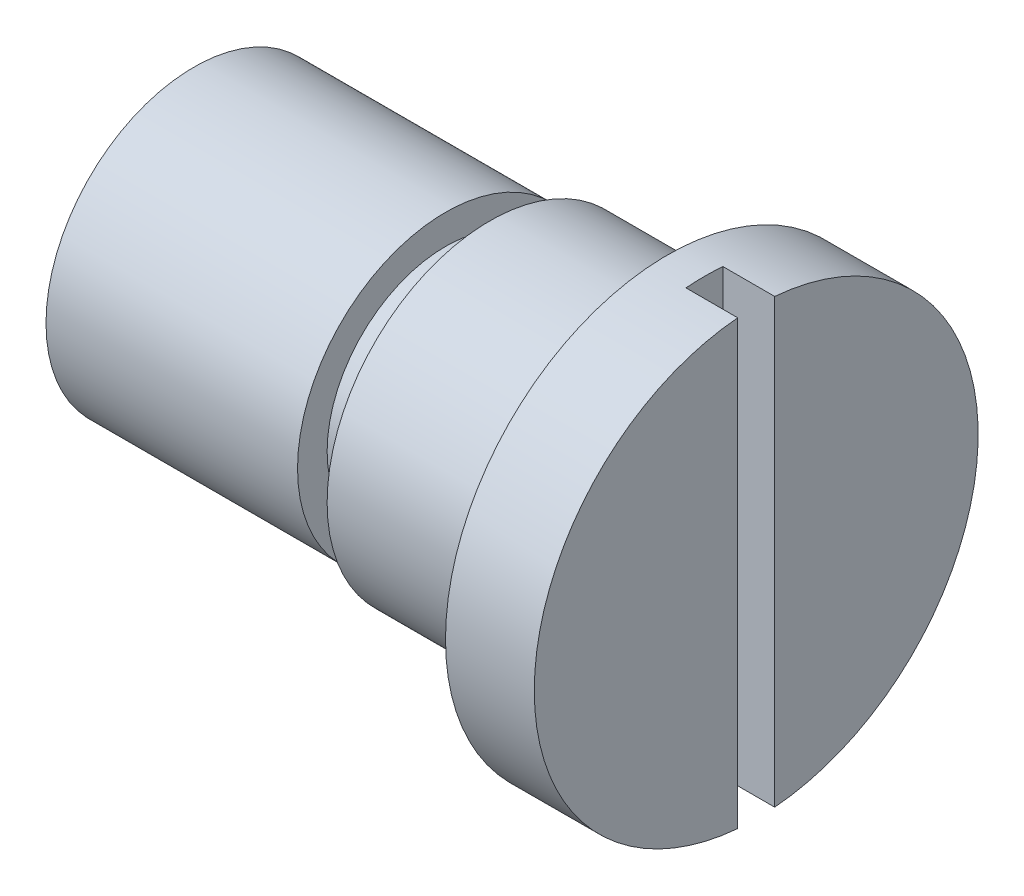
ISO-10303-21;
HEADER;
FILE_DESCRIPTION(('STEP AP214'),'2;1');
FILE_NAME('part.step','',(''),(''),'','','');
FILE_SCHEMA(('AUTOMOTIVE_DESIGN { 1 0 10303 214 1 1 1 1 }'));
ENDSEC;
DATA;
#1=APPLICATION_CONTEXT('core data for automotive mechanical design processes');
#2=APPLICATION_PROTOCOL_DEFINITION('international standard','automotive_design',2000,#1);
#3=PRODUCT_CONTEXT('',#1,'mechanical');
#4=PRODUCT('Part','Part','',(#3));
#5=PRODUCT_RELATED_PRODUCT_CATEGORY('part','',(#4));
#6=PRODUCT_DEFINITION_FORMATION('','',#4);
#7=PRODUCT_DEFINITION_CONTEXT('part definition',#1,'design');
#8=PRODUCT_DEFINITION('design','',#6,#7);
#9=PRODUCT_DEFINITION_SHAPE('','',#8);
#10=(LENGTH_UNIT() NAMED_UNIT(*) SI_UNIT(.MILLI.,.METRE.));
#11=(NAMED_UNIT(*) PLANE_ANGLE_UNIT() SI_UNIT($,.RADIAN.));
#12=(NAMED_UNIT(*) SI_UNIT($,.STERADIAN.) SOLID_ANGLE_UNIT());
#13=UNCERTAINTY_MEASURE_WITH_UNIT(LENGTH_MEASURE(1.E-05),#10,'distance_accuracy_value','');
#14=(GEOMETRIC_REPRESENTATION_CONTEXT(3) GLOBAL_UNCERTAINTY_ASSIGNED_CONTEXT((#13)) GLOBAL_UNIT_ASSIGNED_CONTEXT((#10,
#11,#12)) REPRESENTATION_CONTEXT('',''));
#15=CARTESIAN_POINT('',(0.,0.,0.));
#16=DIRECTION('',(0.,0.,1.));
#17=DIRECTION('',(1.,0.,0.));
#18=AXIS2_PLACEMENT_3D('',#15,#16,#17);
#19=CARTESIAN_POINT('',(38.,15.,0.));
#20=DIRECTION('',(-1.,0.,0.));
#21=DIRECTION('',(0.,0.,1.));
#22=AXIS2_PLACEMENT_3D('',#19,#20,#21);
#23=PLANE('',#22);
#24=CARTESIAN_POINT('',(38.,1.35308431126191E-13,0.));
#25=DIRECTION('',(-1.,0.,0.));
#26=DIRECTION('',(0.,0.,1.));
#27=AXIS2_PLACEMENT_3D('',#24,#25,#26);
#28=CIRCLE('',#27,15.);
#29=CARTESIAN_POINT('',(38.,-14.9478259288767,1.25000000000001));
#30=VERTEX_POINT('',#29);
#31=CARTESIAN_POINT('',(38.,14.9478259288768,1.25));
#32=VERTEX_POINT('',#31);
#33=EDGE_CURVE('E86',#30,#32,#28,.T.);
#34=ORIENTED_EDGE('',*,*,#33,.F.);
#35=DIRECTION('',(0.,1.,0.));
#36=VECTOR('',#35,1.);
#37=CARTESIAN_POINT('',(38.,15.0000000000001,1.25000000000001));
#38=LINE('',#37,#36);
#39=EDGE_CURVE('E110',#30,#32,#38,.T.);
#40=ORIENTED_EDGE('',*,*,#39,.T.);
#41=EDGE_LOOP('',(#34,#40));
#42=FACE_BOUND('',#41,.T.);
#43=ADVANCED_FACE('F24',(#42),#23,.F.);
#44=CARTESIAN_POINT('',(0.,0.,0.));
#45=DIRECTION('',(1.,0.,0.));
#46=DIRECTION('',(0.,0.,-1.));
#47=AXIS2_PLACEMENT_3D('',#44,#45,#46);
#48=PLANE('',#47);
#49=CARTESIAN_POINT('',(0.,0.,0.));
#50=DIRECTION('',(-1.,0.,0.));
#51=DIRECTION('',(0.,0.,1.));
#52=AXIS2_PLACEMENT_3D('',#49,#50,#51);
#53=CIRCLE('',#52,10.);
#54=CARTESIAN_POINT('',(0.,0.,10.));
#55=VERTEX_POINT('',#54);
#56=EDGE_CURVE('E106',#55,#55,#53,.T.);
#57=ORIENTED_EDGE('',*,*,#56,.T.);
#58=EDGE_LOOP('',(#57));
#59=FACE_BOUND('',#58,.T.);
#60=ADVANCED_FACE('F26',(#59),#48,.F.);
#61=CARTESIAN_POINT('',(-36.4678714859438,0.,0.));
#62=DIRECTION('',(-1.,0.,0.));
#63=DIRECTION('',(0.,0.,1.));
#64=AXIS2_PLACEMENT_3D('',#61,#62,#63);
#65=CYLINDRICAL_SURFACE('',#64,10.);
#66=ORIENTED_EDGE('',*,*,#56,.F.);
#67=EDGE_LOOP('',(#66));
#68=FACE_BOUND('',#67,.T.);
#69=CARTESIAN_POINT('',(17.,0.,0.));
#70=DIRECTION('',(-1.,0.,0.));
#71=DIRECTION('',(0.,0.,1.));
#72=AXIS2_PLACEMENT_3D('',#69,#70,#71);
#73=CIRCLE('',#72,10.);
#74=CARTESIAN_POINT('',(17.,0.,10.));
#75=VERTEX_POINT('',#74);
#76=EDGE_CURVE('E103',#75,#75,#73,.T.);
#77=ORIENTED_EDGE('',*,*,#76,.T.);
#78=EDGE_LOOP('',(#77));
#79=FACE_BOUND('',#78,.T.);
#80=ADVANCED_FACE('F125',(#68,#79),#65,.T.);
#81=CARTESIAN_POINT('',(17.,10.,0.));
#82=DIRECTION('',(-1.,0.,0.));
#83=DIRECTION('',(0.,0.,1.));
#84=AXIS2_PLACEMENT_3D('',#81,#82,#83);
#85=PLANE('',#84);
#86=ORIENTED_EDGE('',*,*,#76,.F.);
#87=EDGE_LOOP('',(#86));
#88=FACE_BOUND('',#87,.T.);
#89=CARTESIAN_POINT('',(17.,0.,0.));
#90=DIRECTION('',(-1.,0.,0.));
#91=DIRECTION('',(0.,0.,1.));
#92=AXIS2_PLACEMENT_3D('',#89,#90,#91);
#93=CIRCLE('',#92,8.);
#94=CARTESIAN_POINT('',(17.,0.,8.00000000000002));
#95=VERTEX_POINT('',#94);
#96=EDGE_CURVE('E100',#95,#95,#93,.T.);
#97=ORIENTED_EDGE('',*,*,#96,.T.);
#98=EDGE_LOOP('',(#97));
#99=FACE_BOUND('',#98,.T.);
#100=ADVANCED_FACE('F154',(#88,#99),#85,.F.);
#101=CARTESIAN_POINT('',(-36.4678714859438,0.,0.));
#102=DIRECTION('',(-1.,0.,0.));
#103=DIRECTION('',(0.,0.,1.));
#104=AXIS2_PLACEMENT_3D('',#101,#102,#103);
#105=CYLINDRICAL_SURFACE('',#104,8.);
#106=ORIENTED_EDGE('',*,*,#96,.F.);
#107=EDGE_LOOP('',(#106));
#108=FACE_BOUND('',#107,.T.);
#109=CARTESIAN_POINT('',(20.,0.,0.));
#110=DIRECTION('',(-1.,0.,0.));
#111=DIRECTION('',(0.,0.,1.));
#112=AXIS2_PLACEMENT_3D('',#109,#110,#111);
#113=CIRCLE('',#112,8.);
#114=CARTESIAN_POINT('',(20.,0.,8.00000000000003));
#115=VERTEX_POINT('',#114);
#116=EDGE_CURVE('E97',#115,#115,#113,.T.);
#117=ORIENTED_EDGE('',*,*,#116,.T.);
#118=EDGE_LOOP('',(#117));
#119=FACE_BOUND('',#118,.T.);
#120=ADVANCED_FACE('F150',(#108,#119),#105,.T.);
#121=CARTESIAN_POINT('',(20.,8.00000000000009,0.));
#122=DIRECTION('',(1.,0.,0.));
#123=DIRECTION('',(0.,0.,-1.));
#124=AXIS2_PLACEMENT_3D('',#121,#122,#123);
#125=PLANE('',#124);
#126=ORIENTED_EDGE('',*,*,#116,.F.);
#127=EDGE_LOOP('',(#126));
#128=FACE_BOUND('',#127,.T.);
#129=CARTESIAN_POINT('',(20.,0.,0.));
#130=DIRECTION('',(-1.,0.,0.));
#131=DIRECTION('',(0.,0.,1.));
#132=AXIS2_PLACEMENT_3D('',#129,#130,#131);
#133=CIRCLE('',#132,11.);
#134=CARTESIAN_POINT('',(20.,0.,11.));
#135=VERTEX_POINT('',#134);
#136=EDGE_CURVE('E94',#135,#135,#133,.T.);
#137=ORIENTED_EDGE('',*,*,#136,.T.);
#138=EDGE_LOOP('',(#137));
#139=FACE_BOUND('',#138,.T.);
#140=ADVANCED_FACE('F146',(#128,#139),#125,.F.);
#141=CARTESIAN_POINT('',(-36.4678714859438,0.,0.));
#142=DIRECTION('',(-1.,0.,0.));
#143=DIRECTION('',(0.,0.,1.));
#144=AXIS2_PLACEMENT_3D('',#141,#142,#143);
#145=CYLINDRICAL_SURFACE('',#144,11.);
#146=ORIENTED_EDGE('',*,*,#136,.F.);
#147=EDGE_LOOP('',(#146));
#148=FACE_BOUND('',#147,.T.);
#149=CARTESIAN_POINT('',(32.,1.52655665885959E-13,0.));
#150=DIRECTION('',(-1.,0.,0.));
#151=DIRECTION('',(0.,0.,1.));
#152=AXIS2_PLACEMENT_3D('',#149,#150,#151);
#153=CIRCLE('',#152,11.);
#154=CARTESIAN_POINT('',(32.,1.52503010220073E-13,11.));
#155=VERTEX_POINT('',#154);
#156=EDGE_CURVE('E91',#155,#155,#153,.T.);
#157=ORIENTED_EDGE('',*,*,#156,.T.);
#158=EDGE_LOOP('',(#157));
#159=FACE_BOUND('',#158,.T.);
#160=ADVANCED_FACE('F139',(#148,#159),#145,.T.);
#161=CARTESIAN_POINT('',(32.,11.0000000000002,0.));
#162=DIRECTION('',(1.,0.,0.));
#163=DIRECTION('',(0.,0.,-1.));
#164=AXIS2_PLACEMENT_3D('',#161,#162,#163);
#165=PLANE('',#164);
#166=ORIENTED_EDGE('',*,*,#156,.F.);
#167=EDGE_LOOP('',(#166));
#168=FACE_BOUND('',#167,.T.);
#169=CARTESIAN_POINT('',(32.,1.52655665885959E-13,0.));
#170=DIRECTION('',(-1.,0.,0.));
#171=DIRECTION('',(0.,0.,1.));
#172=AXIS2_PLACEMENT_3D('',#169,#170,#171);
#173=CIRCLE('',#172,15.);
#174=CARTESIAN_POINT('',(32.,1.52447499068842E-13,15.0000000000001));
#175=VERTEX_POINT('',#174);
#176=EDGE_CURVE('E88',#175,#175,#173,.T.);
#177=ORIENTED_EDGE('',*,*,#176,.T.);
#178=EDGE_LOOP('',(#177));
#179=FACE_BOUND('',#178,.T.);
#180=ADVANCED_FACE('F134',(#168,#179),#165,.F.);
#181=CARTESIAN_POINT('',(-36.4678714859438,0.,0.));
#182=DIRECTION('',(-1.,0.,0.));
#183=DIRECTION('',(0.,0.,1.));
#184=AXIS2_PLACEMENT_3D('',#181,#182,#183);
#185=CYLINDRICAL_SURFACE('',#184,15.);
#186=ORIENTED_EDGE('',*,*,#176,.F.);
#187=EDGE_LOOP('',(#186));
#188=FACE_BOUND('',#187,.T.);
#189=ORIENTED_EDGE('',*,*,#33,.T.);
#190=DIRECTION('',(-1.,0.,0.));
#191=VECTOR('',#190,1.);
#192=CARTESIAN_POINT('',(-36.4678714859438,14.9478259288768,1.25000000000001));
#193=LINE('',#192,#191);
#194=CARTESIAN_POINT('',(34.5,14.9478259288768,1.25));
#195=VERTEX_POINT('',#194);
#196=EDGE_CURVE('E80',#32,#195,#193,.T.);
#197=ORIENTED_EDGE('',*,*,#196,.T.);
#198=CARTESIAN_POINT('',(34.5,1.52655665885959E-13,0.));
#199=DIRECTION('',(-1.,0.,0.));
#200=DIRECTION('',(0.,0.,1.));
#201=AXIS2_PLACEMENT_3D('',#198,#199,#200);
#202=CIRCLE('',#201,15.);
#203=CARTESIAN_POINT('',(34.5,14.9478259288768,-1.25));
#204=VERTEX_POINT('',#203);
#205=EDGE_CURVE('E28',#195,#204,#202,.T.);
#206=ORIENTED_EDGE('',*,*,#205,.T.);
#207=DIRECTION('',(-1.,0.,0.));
#208=VECTOR('',#207,1.);
#209=CARTESIAN_POINT('',(-36.4678714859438,14.9478259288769,-1.25000000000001));
#210=LINE('',#209,#208);
#211=CARTESIAN_POINT('',(38.,14.9478259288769,-1.25));
#212=VERTEX_POINT('',#211);
#213=EDGE_CURVE('E71',#204,#212,#210,.F.);
#214=ORIENTED_EDGE('',*,*,#213,.T.);
#215=CARTESIAN_POINT('',(38.,-14.9478259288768,-1.25000000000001));
#216=VERTEX_POINT('',#215);
#217=EDGE_CURVE('E77',#212,#216,#28,.T.);
#218=ORIENTED_EDGE('',*,*,#217,.T.);
#219=DIRECTION('',(-1.,0.,0.));
#220=VECTOR('',#219,1.);
#221=CARTESIAN_POINT('',(-36.4678714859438,-14.9478259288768,-1.25000000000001));
#222=LINE('',#221,#220);
#223=CARTESIAN_POINT('',(34.5,-14.9478259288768,-1.25000000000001));
#224=VERTEX_POINT('',#223);
#225=EDGE_CURVE('E39',#216,#224,#222,.T.);
#226=ORIENTED_EDGE('',*,*,#225,.T.);
#227=CARTESIAN_POINT('',(34.5,-14.9478259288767,1.25000000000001));
#228=VERTEX_POINT('',#227);
#229=EDGE_CURVE('E11',#224,#228,#202,.T.);
#230=ORIENTED_EDGE('',*,*,#229,.T.);
#231=DIRECTION('',(-1.,0.,0.));
#232=VECTOR('',#231,1.);
#233=CARTESIAN_POINT('',(-36.4678714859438,-14.9478259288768,1.25000000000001));
#234=LINE('',#233,#232);
#235=EDGE_CURVE('E78',#228,#30,#234,.F.);
#236=ORIENTED_EDGE('',*,*,#235,.T.);
#237=EDGE_LOOP('',(#189,#197,#206,#214,#218,#226,#230,#236));
#238=FACE_BOUND('',#237,.T.);
#239=ADVANCED_FACE('F75',(#188,#238),#185,.T.);
#240=ORIENTED_EDGE('',*,*,#217,.F.);
#241=DIRECTION('',(0.,-1.,0.));
#242=VECTOR('',#241,1.);
#243=CARTESIAN_POINT('',(38.,15.0000000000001,-1.25));
#244=LINE('',#243,#242);
#245=EDGE_CURVE('E109',#212,#216,#244,.T.);
#246=ORIENTED_EDGE('',*,*,#245,.T.);
#247=EDGE_LOOP('',(#240,#246));
#248=FACE_BOUND('',#247,.T.);
#249=ADVANCED_FACE('F119',(#248),#23,.F.);
#250=CARTESIAN_POINT('',(34.5,-15.,-1.25000000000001));
#251=DIRECTION('',(-1.,0.,0.));
#252=DIRECTION('',(0.,0.,1.));
#253=AXIS2_PLACEMENT_3D('',#250,#251,#252);
#254=PLANE('',#253);
#255=DIRECTION('',(0.,1.,0.));
#256=VECTOR('',#255,1.);
#257=CARTESIAN_POINT('',(34.5,-15.,1.25000000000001));
#258=LINE('',#257,#256);
#259=EDGE_CURVE('E66',#228,#195,#258,.T.);
#260=ORIENTED_EDGE('',*,*,#259,.F.);
#261=ORIENTED_EDGE('',*,*,#229,.F.);
#262=DIRECTION('',(0.,1.,0.));
#263=VECTOR('',#262,1.);
#264=CARTESIAN_POINT('',(34.5,-15.,-1.25000000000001));
#265=LINE('',#264,#263);
#266=EDGE_CURVE('E65',#224,#204,#265,.T.);
#267=ORIENTED_EDGE('',*,*,#266,.T.);
#268=ORIENTED_EDGE('',*,*,#205,.F.);
#269=EDGE_LOOP('',(#260,#261,#267,#268));
#270=FACE_BOUND('',#269,.T.);
#271=ADVANCED_FACE('F64',(#270),#254,.F.);
#272=CARTESIAN_POINT('',(38.,-15.,1.25));
#273=DIRECTION('',(0.,0.,1.));
#274=DIRECTION('',(1.,0.,0.));
#275=AXIS2_PLACEMENT_3D('',#272,#273,#274);
#276=PLANE('',#275);
#277=ORIENTED_EDGE('',*,*,#39,.F.);
#278=ORIENTED_EDGE('',*,*,#235,.F.);
#279=ORIENTED_EDGE('',*,*,#259,.T.);
#280=ORIENTED_EDGE('',*,*,#196,.F.);
#281=EDGE_LOOP('',(#277,#278,#279,#280));
#282=FACE_BOUND('',#281,.T.);
#283=ADVANCED_FACE('F115',(#282),#276,.F.);
#284=CARTESIAN_POINT('',(38.,-15.,-1.25));
#285=DIRECTION('',(0.,0.,-1.));
#286=DIRECTION('',(-1.,0.,0.));
#287=AXIS2_PLACEMENT_3D('',#284,#285,#286);
#288=PLANE('',#287);
#289=ORIENTED_EDGE('',*,*,#245,.F.);
#290=ORIENTED_EDGE('',*,*,#213,.F.);
#291=ORIENTED_EDGE('',*,*,#266,.F.);
#292=ORIENTED_EDGE('',*,*,#225,.F.);
#293=EDGE_LOOP('',(#289,#290,#291,#292));
#294=FACE_BOUND('',#293,.T.);
#295=ADVANCED_FACE('F69',(#294),#288,.F.);
#296=CLOSED_SHELL('',(#43,#60,#80,#100,#120,#140,#160,#180,#239,#249,#271,#283,#295));
#297=MANIFOLD_SOLID_BREP('B2',#296);
#298=ADVANCED_BREP_SHAPE_REPRESENTATION('',(#18,#297),#14);
#299=SHAPE_DEFINITION_REPRESENTATION(#9,#298);
ENDSEC;
END-ISO-10303-21;
